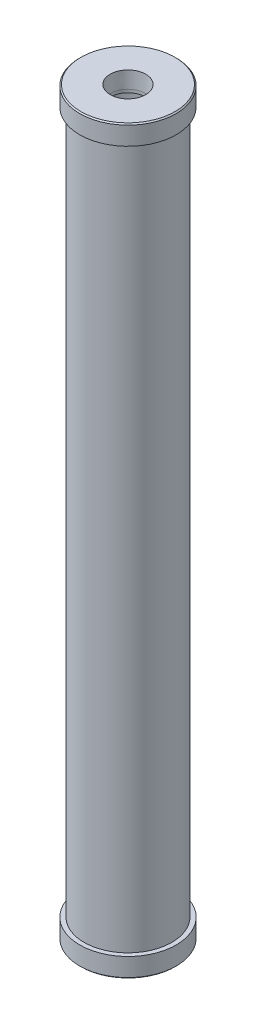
from build123d import *

# Parameters (mm, degrees)
SKETCH1_R           = 57.15
SKETCH1_R_2         = 50.546
BOSS_EXTRUDE1_DEPTH = 965.2
SKETCH2_R           = 62.865
BOSS_EXTRUDE2_DEPTH = 25.4
BOSS_EXTRUDE3_START = -25.4
SKETCH5_R           = 62.865
BOSS_EXTRUDE3_DEPTH = 25.4
CHAMFER1_SIZE       = 1.524


with BuildPart() as part:
    # Sketch1 → Boss-Extrude1 (new body)
    with BuildSketch(Plane(origin=(0, 0, 0), x_dir=(1, 0, 0), z_dir=(0, 1, 0))):
        with Locations(Location((0, 0, 0), (0, 0, 90))):
            Circle(SKETCH1_R)
        with Locations(Location((0, 0, 0), (0, 0, 90))):
            Circle(SKETCH1_R_2, mode=Mode.SUBTRACT)
    extrude(amount=BOSS_EXTRUDE1_DEPTH)

    # Sketch2 → Boss-Extrude2 (add)
    with BuildSketch(Plane(origin=(0, 0, 0), x_dir=(1, 0, 0), z_dir=(0, 1, 0))):
        with Locations(Location((0, 0, 0), (0, 0, 270))):
            Circle(SKETCH2_R)
    extrude(amount=BOSS_EXTRUDE2_DEPTH)

    # Sketch3 → 1-1_2 Rc Tapped Hole1 (revolve, cut)
    with BuildSketch(Plane(origin=(0, 0, 0), x_dir=(0, 0, -1), z_dir=(1, 0, 0))):
        Polygon((0, 0), (0, 46.34544999), (22.6, 32.766), (22.6, 21.336), (22.493964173, 21.336), (23.160002, 0), align=None)
    revolve(axis=Axis((0, -6.35, 0), (0, 1, 0)), mode=Mode.SUBTRACT)

    # Sketch5 → Boss-Extrude3 (add)
    with BuildSketch(Plane(origin=(0, 965.2, 0), x_dir=(1, 0, 0), z_dir=(0, 1, 0)).offset(BOSS_EXTRUDE3_START)):
        with Locations(Location((0, 0, 0), (0, 0, 270))):
            Circle(SKETCH5_R)
    extrude(amount=BOSS_EXTRUDE3_DEPTH)

    # Sketch6 → 1-1_2 Rc Tapped Hole2 (revolve, cut)
    with BuildSketch(Plane(origin=(0, 965.2, 0), x_dir=(0, 0, 1), z_dir=(1, 0, 0))):
        Polygon((0, 0), (0, 46.34544999), (22.6, 32.766), (22.6, 21.336), (22.493964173, 21.336), (23.160002, 0), align=None)
    revolve(axis=Axis((0, 971.55, 0), (0, -1, 0)), mode=Mode.SUBTRACT)

    # Chamfer1
    chamfer1_edges = [part.edges().sort_by_distance(p)[0] for p in [
        (0, 0, -62.865),
        (0, 965.2, -62.865),
    ]]
    chamfer(chamfer1_edges, length=CHAMFER1_SIZE)


solid = part.part
